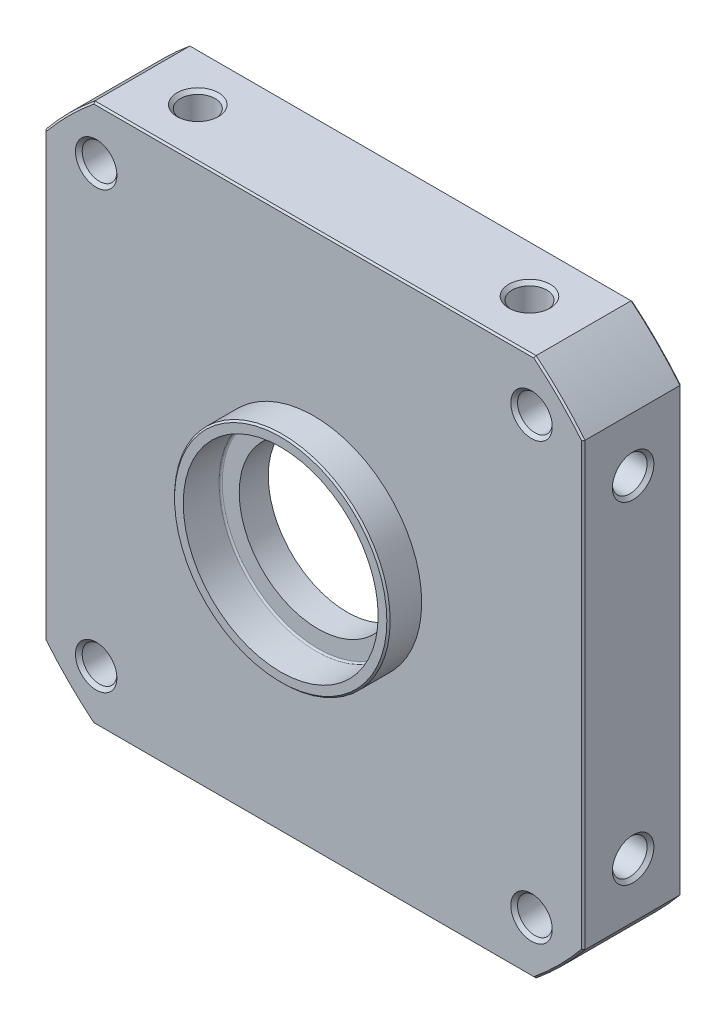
from build123d import *

# Parameters (mm, degrees)
LINEAR_AUSTRAGEN1_DEPTH      = 35
LINEAR_AUSTRAGEN2_DEPTH      = 65
LINEAR_AUSTRAGEN2_DEPTH_BACK = 65
LINEAR_AUSTRAGEN3_DEPTH      = 65
LINEAR_AUSTRAGEN3_DEPTH_BACK = 65
LINEAR_AUSTRAGEN4_DEPTH      = 65
LINEAR_AUSTRAGEN4_DEPTH_BACK = 65
LINEAR_AUSTRAGEN5_DEPTH      = 65
LINEAR_AUSTRAGEN5_DEPTH_BACK = 65


with BuildPart() as part:
    # Skizze1 → Linear austragen1 (new body)
    with BuildSketch(Plane.XY):
        with BuildLine():
            Line((-65, 53.207142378), (-65, -53.207142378))
            ThreePointArc((-65, -53.207142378), (-59.39696962, -59.39696962), (-53.207142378, -65))
            Line((-53.207142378, -65), (53.207142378, -65))
            ThreePointArc((53.207142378, -65), (59.39696962, -59.39696962), (65, -53.207142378))
            Line((65, -53.207142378), (65, 53.207142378))
            ThreePointArc((65, 53.207142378), (59.39696962, 59.39696962), (53.207142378, 65))
            Line((53.207142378, 65), (-53.207142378, 65))
            ThreePointArc((-53.207142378, 65), (-59.39696962, 59.39696962), (-65, 53.207142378))
        make_face()
    extrude(amount=LINEAR_AUSTRAGEN1_DEPTH)

    # Skizze3 → Schnitt-Rotation1 (revolve, cut)
    with BuildSketch(Plane(origin=(0, 0, 0), x_dir=(0, 0, -1), z_dir=(1, 0, 0)), mode=Mode.PRIVATE) as schnitt_rotation1_sk:
        with BuildLine():
            Line((0, 0), (0, -49))
            Line((0, -49), (-15, -49))
            ThreePointArc((-15, -49), (-17.828427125, -47.828427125), (-19, -45))
            Line((-19, -45), (-19, -19))
            Line((-19, -19), (-26, -19))
            Line((-26, -19), (-26, -23.1))
            ThreePointArc((-26, -23.1), (-26.117157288, -23.382842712), (-26.4, -23.5))
            Line((-26.4, -23.5), (-35, -23.5))
            Line((-35, -23.5), (-35, 0))
            Line((-35, 0), (0, 0))
        make_face()
    revolve(schnitt_rotation1_sk.sketch.rotate(Axis((0, 0, 35), (0, 0, -1)), 90), axis=Axis((0, 0, 35), (0, 0, -1)), mode=Mode.SUBTRACT)

    # Skizze4 → Schnitt-Rotation2 (revolve, cut)
    with BuildSketch(Plane(origin=(0, 0, 0), x_dir=(0, 0, -1), z_dir=(1, 0, 0)), mode=Mode.PRIVATE) as schnitt_rotation2_sk:
        Polygon((-35, 91), (-35, 25.6), (-34.6, 26), (-27, 26), (-27, 91), align=None)
    revolve(schnitt_rotation2_sk.sketch.rotate(Axis((0, 0, -25), (0, 0, 1)), 270), axis=Axis((0, 0, -25), (0, 0, 1)), mode=Mode.SUBTRACT)

    # Skizze5 → Schnitt-Rotation3 (revolve, cut)
    with BuildSketch(Plane(origin=(0, 0, 0), x_dir=(0, 0, -1), z_dir=(1, 0, 0)), mode=Mode.PRIVATE) as schnitt_rotation3_sk:
        Polygon((-3.3, 51), (-0.3, 51), (0, 50.7), (0, 101), (-3.3, 101), align=None)
    revolve(schnitt_rotation3_sk.sketch.rotate(Axis((0, 0, -20), (0, 0, 1)), 270), axis=Axis((0, 0, -20), (0, 0, 1)), mode=Mode.SUBTRACT)

    # Skizze6 → Schnitt-Rotation4 (revolve, cut)
    with BuildSketch(Plane(origin=(0, 52.5, 0), x_dir=(-1, 0, 0), z_dir=(0, 1, 0)), mode=Mode.PRIVATE) as schnitt_rotation4_sk:
        Polygon((-52.5, 3.3), (-57.5, 3.3), (-56.688, 4.112), (-56.688, 26.188), (-57.5, 27), (-52.5, 27), align=None)
    revolve(schnitt_rotation4_sk.sketch.rotate(Axis((52.5, 52.5, 27), (0, 0, -1)), 180), axis=Axis((52.5, 52.5, 27), (0, 0, -1)), mode=Mode.SUBTRACT)

    # Skizze7 → Schnitt-Rotation5 (revolve, cut)
    with BuildSketch(Plane(origin=(0, 52.5, 0), x_dir=(-1, 0, 0), z_dir=(0, 1, 0)), mode=Mode.PRIVATE) as schnitt_rotation5_sk:
        Polygon((52.5, 3.3), (47.5, 3.3), (48.312, 4.112), (48.312, 26.188), (47.5, 27), (52.5, 27), align=None)
    revolve(schnitt_rotation5_sk.sketch.rotate(Axis((-52.5, 52.5, 27), (0, 0, -1)), 180), axis=Axis((-52.5, 52.5, 27), (0, 0, -1)), mode=Mode.SUBTRACT)

    # Skizze8 → Schnitt-Rotation6 (revolve, cut)
    with BuildSketch(Plane(origin=(0, -52.5, 0), x_dir=(-1, 0, 0), z_dir=(0, 1, 0)), mode=Mode.PRIVATE) as schnitt_rotation6_sk:
        Polygon((-52.5, 3.3), (-57.5, 3.3), (-56.688, 4.112), (-56.688, 26.188), (-57.5, 27), (-52.5, 27), align=None)
    revolve(schnitt_rotation6_sk.sketch.rotate(Axis((52.5, -52.5, 27), (0, 0, -1)), 180), axis=Axis((52.5, -52.5, 27), (0, 0, -1)), mode=Mode.SUBTRACT)

    # Skizze9 → Schnitt-Rotation7 (revolve, cut)
    with BuildSketch(Plane(origin=(0, -52.5, 0), x_dir=(-1, 0, 0), z_dir=(0, 1, 0)), mode=Mode.PRIVATE) as schnitt_rotation7_sk:
        Polygon((52.5, 3.3), (47.5, 3.3), (48.312, 4.112), (48.312, 26.188), (47.5, 27), (52.5, 27), align=None)
    revolve(schnitt_rotation7_sk.sketch.rotate(Axis((-52.5, -52.5, 27), (0, 0, -1)), 180), axis=Axis((-52.5, -52.5, 27), (0, 0, -1)), mode=Mode.SUBTRACT)

    # Skizze10 → Schnitt-Rotation8 (revolve, cut)
    with BuildSketch(Plane.XY.offset(15), mode=Mode.PRIVATE) as schnitt_rotation8_sk:
        Polygon((40, 65), (45, 65), (44.188, 64.188), (44.188, 45.4), (40, 42.982057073), align=None)
    revolve(schnitt_rotation8_sk.sketch.rotate(Axis((40, 42.982057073, 15), (0, 1, 0)), 270), axis=Axis((40, 42.982057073, 15), (0, 1, 0)), mode=Mode.SUBTRACT)

    # Skizze11 → Schnitt-Rotation9 (revolve, cut)
    with BuildSketch(Plane.XY.offset(15), mode=Mode.PRIVATE) as schnitt_rotation9_sk:
        Polygon((-40, 65), (-35, 65), (-35.812, 64.188), (-35.812, 45.4), (-40, 42.982057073), align=None)
    revolve(schnitt_rotation9_sk.sketch.rotate(Axis((-40, 42.982057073, 15), (0, 1, 0)), 270), axis=Axis((-40, 42.982057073, 15), (0, 1, 0)), mode=Mode.SUBTRACT)

    # Skizze12 → Schnitt-Rotation10 (revolve, cut)
    with BuildSketch(Plane.XY.offset(15), mode=Mode.PRIVATE) as schnitt_rotation10_sk:
        Polygon((65, 40), (65, 35), (64.188, 35.812), (45.4, 35.812), (42.982057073, 40), align=None)
    revolve(schnitt_rotation10_sk.sketch.rotate(Axis((42.982057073, 40, 15), (1, 0, 0)), 90), axis=Axis((42.982057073, 40, 15), (1, 0, 0)), mode=Mode.SUBTRACT)

    # Skizze13 → Schnitt-Rotation11 (revolve, cut)
    with BuildSketch(Plane.XY.offset(15), mode=Mode.PRIVATE) as schnitt_rotation11_sk:
        Polygon((65, -40), (65, -45), (64.188, -44.188), (45.4, -44.188), (42.982057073, -40), align=None)
    revolve(schnitt_rotation11_sk.sketch.rotate(Axis((42.982057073, -40, 15), (1, 0, 0)), 90), axis=Axis((42.982057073, -40, 15), (1, 0, 0)), mode=Mode.SUBTRACT)

    # Skizze14 → Schnitt-Rotation12 (revolve, cut)
    with BuildSketch(Plane.XY.offset(15), mode=Mode.PRIVATE) as schnitt_rotation12_sk:
        Polygon((-65, 40), (-65, 45), (-64.188, 44.188), (-45.4, 44.188), (-42.982057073, 40), align=None)
    revolve(schnitt_rotation12_sk.sketch.rotate(Axis((-42.982057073, 40, 15), (-1, 0, 0)), 270), axis=Axis((-42.982057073, 40, 15), (-1, 0, 0)), mode=Mode.SUBTRACT)

    # Skizze15 → Schnitt-Rotation13 (revolve, cut)
    with BuildSketch(Plane.XY.offset(15), mode=Mode.PRIVATE) as schnitt_rotation13_sk:
        Polygon((-65, -40), (-65, -35), (-64.188, -35.812), (-45.4, -35.812), (-42.982057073, -40), align=None)
    revolve(schnitt_rotation13_sk.sketch.rotate(Axis((-42.982057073, -40, 15), (-1, 0, 0)), 270), axis=Axis((-42.982057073, -40, 15), (-1, 0, 0)), mode=Mode.SUBTRACT)

    # Skizze2 → Schnitt-Rotation14 (revolve, cut)
    with BuildSketch(Plane(origin=(0, 0, 0), x_dir=(0, 0, -1), z_dir=(1, 0, 0))):
        Polygon((-27, 83.6), (-26.6, 84), (-3.7, 84), (-3.3, 83.6), (-3.3, 92), (-27, 92), align=None)
    revolve(axis=Axis((0, 0, 3.3), (0, 0, 1)), mode=Mode.SUBTRACT)

    # Skizze16 → Linear austragen2 (cut, two sides: drawn at the far end of the back side and taken through both)
    with BuildSketch(Plane(origin=(0, 0, 0), x_dir=(0, 0, -1), z_dir=(1, 0, 0)).offset(-LINEAR_AUSTRAGEN2_DEPTH_BACK)):
        Polygon((-27, 64.6), (-26.6, 65), (-3.7, 65), (-3.3, 64.6), (-3.3, 69.6), (-27, 69.6), align=None)
    extrude(amount=LINEAR_AUSTRAGEN2_DEPTH + LINEAR_AUSTRAGEN2_DEPTH_BACK, mode=Mode.SUBTRACT)

    # Skizze17 → Linear austragen3 (cut, two sides: drawn at the far end of the back side and taken through both)
    with BuildSketch(Plane(origin=(0, 0, 0), x_dir=(0, 0, -1), z_dir=(1, 0, 0)).offset(-LINEAR_AUSTRAGEN3_DEPTH_BACK)):
        Polygon((-27, -64.6), (-27, -69.6), (-3.3, -69.6), (-3.3, -64.6), (-3.7, -65), (-26.6, -65), align=None)
    extrude(amount=LINEAR_AUSTRAGEN3_DEPTH + LINEAR_AUSTRAGEN3_DEPTH_BACK, mode=Mode.SUBTRACT)

    # Skizze18 → Linear austragen4 (cut, two sides: drawn at the far end of the back side and taken through both)
    with BuildSketch(Plane(origin=(0, 0, 0), x_dir=(1, 0, 0), z_dir=(0, 1, 0)).offset(-LINEAR_AUSTRAGEN4_DEPTH_BACK)):
        Polygon((-69.6, -27), (-64.6, -27), (-65, -26.6), (-65, -3.7), (-64.6, -3.3), (-69.6, -3.3), align=None)
    extrude(amount=LINEAR_AUSTRAGEN4_DEPTH + LINEAR_AUSTRAGEN4_DEPTH_BACK, mode=Mode.SUBTRACT)

    # Skizze19 → Linear austragen5 (cut, two sides: drawn at the far end of the back side and taken through both)
    with BuildSketch(Plane(origin=(0, 0, 0), x_dir=(1, 0, 0), z_dir=(0, 1, 0)).offset(-LINEAR_AUSTRAGEN5_DEPTH_BACK)):
        Polygon((64.6, -3.3), (65, -3.7), (65, -26.6), (64.6, -27), (69.6, -27), (69.6, -3.3), align=None)
    extrude(amount=LINEAR_AUSTRAGEN5_DEPTH + LINEAR_AUSTRAGEN5_DEPTH_BACK, mode=Mode.SUBTRACT)


solid = part.part
